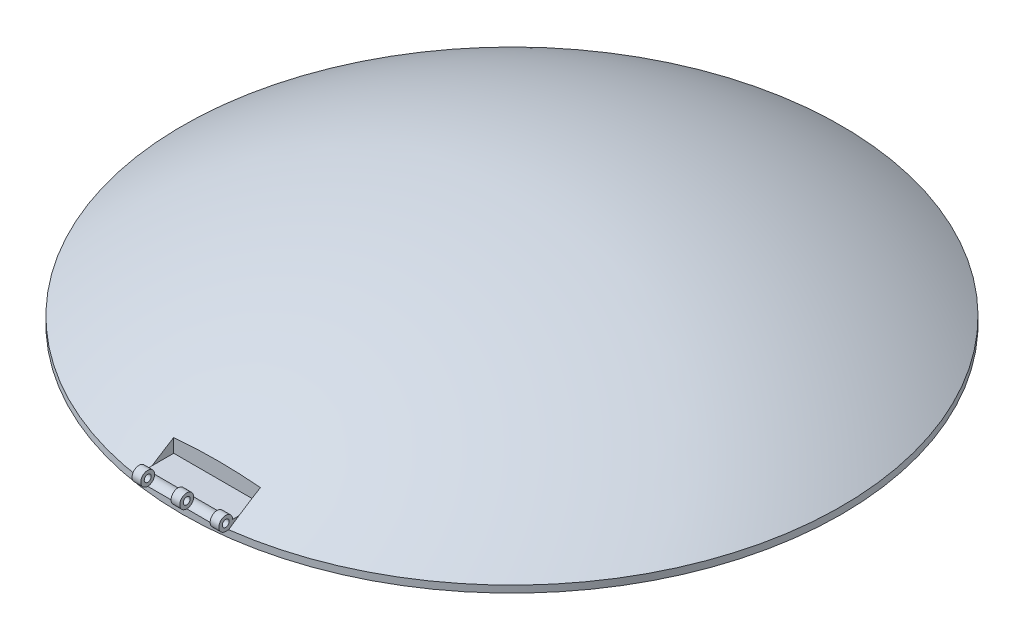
ISO-10303-21;
HEADER;
FILE_DESCRIPTION(('STEP AP214'),'2;1');
FILE_NAME('part.step','',(''),(''),'','','');
FILE_SCHEMA(('AUTOMOTIVE_DESIGN { 1 0 10303 214 1 1 1 1 }'));
ENDSEC;
DATA;
#1=APPLICATION_CONTEXT('core data for automotive mechanical design processes');
#2=APPLICATION_PROTOCOL_DEFINITION('international standard','automotive_design',2000,#1);
#3=PRODUCT_CONTEXT('',#1,'mechanical');
#4=PRODUCT('Part','Part','',(#3));
#5=PRODUCT_RELATED_PRODUCT_CATEGORY('part','',(#4));
#6=PRODUCT_DEFINITION_FORMATION('','',#4);
#7=PRODUCT_DEFINITION_CONTEXT('part definition',#1,'design');
#8=PRODUCT_DEFINITION('design','',#6,#7);
#9=PRODUCT_DEFINITION_SHAPE('','',#8);
#10=(LENGTH_UNIT() NAMED_UNIT(*) SI_UNIT(.MILLI.,.METRE.));
#11=(NAMED_UNIT(*) PLANE_ANGLE_UNIT() SI_UNIT($,.RADIAN.));
#12=(NAMED_UNIT(*) SI_UNIT($,.STERADIAN.) SOLID_ANGLE_UNIT());
#13=UNCERTAINTY_MEASURE_WITH_UNIT(LENGTH_MEASURE(1.E-05),#10,'distance_accuracy_value','');
#14=(GEOMETRIC_REPRESENTATION_CONTEXT(3) GLOBAL_UNCERTAINTY_ASSIGNED_CONTEXT((#13)) GLOBAL_UNIT_ASSIGNED_CONTEXT((#10,
#11,#12)) REPRESENTATION_CONTEXT('',''));
#15=CARTESIAN_POINT('',(0.,0.,0.));
#16=DIRECTION('',(0.,0.,1.));
#17=DIRECTION('',(1.,0.,0.));
#18=AXIS2_PLACEMENT_3D('',#15,#16,#17);
#19=CARTESIAN_POINT('',(-15.875,5.07999999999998,107.95));
#20=DIRECTION('',(0.,1.,0.));
#21=DIRECTION('',(-1.,0.,0.));
#22=AXIS2_PLACEMENT_3D('',#19,#20,#21);
#23=PLANE('',#22);
#24=DIRECTION('',(-1.,0.,0.));
#25=VECTOR('',#24,1.);
#26=CARTESIAN_POINT('',(-12.7,5.07999999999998,118.11));
#27=LINE('',#26,#25);
#28=CARTESIAN_POINT('',(-12.7,5.07999999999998,118.11));
#29=VERTEX_POINT('',#28);
#30=CARTESIAN_POINT('',(-15.875,5.07999999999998,118.11));
#31=VERTEX_POINT('',#30);
#32=EDGE_CURVE('E39',#29,#31,#27,.T.);
#33=ORIENTED_EDGE('',*,*,#32,.F.);
#34=DIRECTION('',(-1.,0.,0.));
#35=VECTOR('',#34,1.);
#36=CARTESIAN_POINT('',(5.59670489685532,5.07999999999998,118.11));
#37=LINE('',#36,#35);
#38=CARTESIAN_POINT('',(-1.5875,5.07999999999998,118.11));
#39=VERTEX_POINT('',#38);
#40=EDGE_CURVE('E111',#29,#39,#37,.F.);
#41=ORIENTED_EDGE('',*,*,#40,.T.);
#42=DIRECTION('',(-1.,0.,0.));
#43=VECTOR('',#42,1.);
#44=CARTESIAN_POINT('',(1.5875,5.07999999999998,118.11));
#45=LINE('',#44,#43);
#46=CARTESIAN_POINT('',(1.5875,5.07999999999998,118.11));
#47=VERTEX_POINT('',#46);
#48=EDGE_CURVE('E207',#39,#47,#45,.F.);
#49=ORIENTED_EDGE('',*,*,#48,.T.);
#50=DIRECTION('',(-1.,0.,0.));
#51=VECTOR('',#50,1.);
#52=CARTESIAN_POINT('',(19.8842048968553,5.07999999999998,118.11));
#53=LINE('',#52,#51);
#54=CARTESIAN_POINT('',(12.7,5.07999999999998,118.11));
#55=VERTEX_POINT('',#54);
#56=EDGE_CURVE('E223',#47,#55,#53,.F.);
#57=ORIENTED_EDGE('',*,*,#56,.T.);
#58=DIRECTION('',(1.,0.,0.));
#59=VECTOR('',#58,1.);
#60=CARTESIAN_POINT('',(12.7,5.07999999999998,118.11));
#61=LINE('',#60,#59);
#62=CARTESIAN_POINT('',(15.875,5.07999999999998,118.11));
#63=VERTEX_POINT('',#62);
#64=EDGE_CURVE('E128',#63,#55,#61,.F.);
#65=ORIENTED_EDGE('',*,*,#64,.F.);
#66=DIRECTION('',(0.,0.,-1.));
#67=VECTOR('',#66,1.);
#68=CARTESIAN_POINT('',(15.875,5.07999999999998,120.65));
#69=LINE('',#68,#67);
#70=CARTESIAN_POINT('',(15.875,5.07999999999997,115.863286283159));
#71=VERTEX_POINT('',#70);
#72=EDGE_CURVE('E165',#63,#71,#69,.T.);
#73=ORIENTED_EDGE('',*,*,#72,.T.);
#74=CARTESIAN_POINT('',(15.875,5.07999999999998,107.95));
#75=VERTEX_POINT('',#74);
#76=EDGE_CURVE('E164',#71,#75,#69,.T.);
#77=ORIENTED_EDGE('',*,*,#76,.T.);
#78=DIRECTION('',(-1.,0.,0.));
#79=VECTOR('',#78,1.);
#80=CARTESIAN_POINT('',(15.875,5.07999999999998,107.95));
#81=LINE('',#80,#79);
#82=CARTESIAN_POINT('',(-15.875,5.07999999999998,107.95));
#83=VERTEX_POINT('',#82);
#84=EDGE_CURVE('E158',#75,#83,#81,.T.);
#85=ORIENTED_EDGE('',*,*,#84,.T.);
#86=DIRECTION('',(0.,0.,1.));
#87=VECTOR('',#86,1.);
#88=CARTESIAN_POINT('',(-15.875,5.07999999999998,107.95));
#89=LINE('',#88,#87);
#90=CARTESIAN_POINT('',(-15.875,5.07999999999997,115.863286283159));
#91=VERTEX_POINT('',#90);
#92=EDGE_CURVE('E162',#83,#91,#89,.T.);
#93=ORIENTED_EDGE('',*,*,#92,.T.);
#94=EDGE_CURVE('E54',#91,#31,#89,.T.);
#95=ORIENTED_EDGE('',*,*,#94,.T.);
#96=EDGE_LOOP('',(#33,#41,#49,#57,#65,#73,#77,#85,#93,#95));
#97=FACE_BOUND('',#96,.T.);
#98=ADVANCED_FACE('F31',(#97),#23,.T.);
#99=CARTESIAN_POINT('',(19.4671024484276,5.07999999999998,120.65));
#100=DIRECTION('',(-1.,0.,0.));
#101=DIRECTION('',(0.,-1.,0.));
#102=AXIS2_PLACEMENT_3D('',#99,#100,#101);
#103=CYLINDRICAL_SURFACE('',#102,1.26999999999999);
#104=CARTESIAN_POINT('',(-15.875,5.07999999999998,120.65));
#105=DIRECTION('',(-1.,0.,0.));
#106=DIRECTION('',(0.,-1.,0.));
#107=AXIS2_PLACEMENT_3D('',#104,#105,#106);
#108=CIRCLE('',#107,1.26999999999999);
#109=CARTESIAN_POINT('',(-15.875,3.80999999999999,120.65));
#110=VERTEX_POINT('',#109);
#111=EDGE_CURVE('E282',#110,#110,#108,.T.);
#112=CARTESIAN_POINT('',(-12.7,5.07999999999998,120.65));
#113=DIRECTION('',(-1.,0.,0.));
#114=DIRECTION('',(0.,-1.,0.));
#115=AXIS2_PLACEMENT_3D('',#112,#113,#114);
#116=CIRCLE('',#115,1.26999999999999);
#117=CARTESIAN_POINT('',(-12.7,3.80999999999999,120.65));
#118=VERTEX_POINT('',#117);
#119=EDGE_CURVE('E11',#118,#118,#116,.T.);
#120=CARTESIAN_POINT('',(-15.875,3.80999999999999,120.65));
#121=CARTESIAN_POINT('',(-15.8419270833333,3.80999999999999,120.65));
#122=CARTESIAN_POINT('',(-15.8088541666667,3.80999999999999,120.65));
#123=CARTESIAN_POINT('',(-15.7427083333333,3.80999999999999,120.65));
#124=CARTESIAN_POINT('',(-15.7096354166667,3.80999999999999,120.65));
#125=CARTESIAN_POINT('',(-15.6434895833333,3.80999999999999,120.65));
#126=CARTESIAN_POINT('',(-15.6104166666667,3.80999999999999,120.65));
#127=CARTESIAN_POINT('',(-15.5442708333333,3.80999999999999,120.65));
#128=CARTESIAN_POINT('',(-15.5111979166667,3.80999999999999,120.65));
#129=CARTESIAN_POINT('',(-15.4450520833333,3.80999999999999,120.65));
#130=CARTESIAN_POINT('',(-15.4119791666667,3.80999999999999,120.65));
#131=CARTESIAN_POINT('',(-15.3458333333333,3.80999999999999,120.65));
#132=CARTESIAN_POINT('',(-15.3127604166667,3.80999999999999,120.65));
#133=CARTESIAN_POINT('',(-15.2466145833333,3.80999999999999,120.65));
#134=CARTESIAN_POINT('',(-15.2135416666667,3.80999999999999,120.65));
#135=CARTESIAN_POINT('',(-15.1473958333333,3.80999999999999,120.65));
#136=CARTESIAN_POINT('',(-15.1143229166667,3.80999999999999,120.65));
#137=CARTESIAN_POINT('',(-15.0481770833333,3.80999999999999,120.65));
#138=CARTESIAN_POINT('',(-15.0151041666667,3.80999999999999,120.65));
#139=CARTESIAN_POINT('',(-14.9489583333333,3.80999999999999,120.65));
#140=CARTESIAN_POINT('',(-14.9158854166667,3.80999999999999,120.65));
#141=CARTESIAN_POINT('',(-14.8497395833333,3.80999999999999,120.65));
#142=CARTESIAN_POINT('',(-14.8166666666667,3.80999999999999,120.65));
#143=CARTESIAN_POINT('',(-14.7505208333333,3.80999999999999,120.65));
#144=CARTESIAN_POINT('',(-14.7174479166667,3.80999999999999,120.65));
#145=CARTESIAN_POINT('',(-14.6513020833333,3.80999999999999,120.65));
#146=CARTESIAN_POINT('',(-14.6182291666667,3.80999999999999,120.65));
#147=CARTESIAN_POINT('',(-14.5520833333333,3.80999999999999,120.65));
#148=CARTESIAN_POINT('',(-14.5190104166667,3.80999999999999,120.65));
#149=CARTESIAN_POINT('',(-14.4528645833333,3.80999999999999,120.65));
#150=CARTESIAN_POINT('',(-14.4197916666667,3.80999999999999,120.65));
#151=CARTESIAN_POINT('',(-14.3536458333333,3.80999999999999,120.65));
#152=CARTESIAN_POINT('',(-14.3205729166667,3.80999999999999,120.65));
#153=CARTESIAN_POINT('',(-14.2544270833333,3.80999999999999,120.65));
#154=CARTESIAN_POINT('',(-14.2213541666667,3.80999999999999,120.65));
#155=CARTESIAN_POINT('',(-14.1552083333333,3.80999999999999,120.65));
#156=CARTESIAN_POINT('',(-14.1221354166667,3.80999999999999,120.65));
#157=CARTESIAN_POINT('',(-14.0559895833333,3.80999999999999,120.65));
#158=CARTESIAN_POINT('',(-14.0229166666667,3.80999999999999,120.65));
#159=CARTESIAN_POINT('',(-13.9567708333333,3.80999999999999,120.65));
#160=CARTESIAN_POINT('',(-13.9236979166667,3.80999999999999,120.65));
#161=CARTESIAN_POINT('',(-13.8575520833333,3.80999999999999,120.65));
#162=CARTESIAN_POINT('',(-13.8244791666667,3.80999999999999,120.65));
#163=CARTESIAN_POINT('',(-13.7583333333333,3.80999999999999,120.65));
#164=CARTESIAN_POINT('',(-13.7252604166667,3.80999999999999,120.65));
#165=CARTESIAN_POINT('',(-13.6591145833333,3.80999999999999,120.65));
#166=CARTESIAN_POINT('',(-13.6260416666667,3.80999999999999,120.65));
#167=CARTESIAN_POINT('',(-13.5598958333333,3.80999999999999,120.65));
#168=CARTESIAN_POINT('',(-13.5268229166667,3.80999999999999,120.65));
#169=CARTESIAN_POINT('',(-13.4606770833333,3.80999999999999,120.65));
#170=CARTESIAN_POINT('',(-13.4276041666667,3.80999999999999,120.65));
#171=CARTESIAN_POINT('',(-13.3614583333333,3.80999999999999,120.65));
#172=CARTESIAN_POINT('',(-13.3283854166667,3.80999999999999,120.65));
#173=CARTESIAN_POINT('',(-13.2622395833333,3.80999999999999,120.65));
#174=CARTESIAN_POINT('',(-13.2291666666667,3.80999999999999,120.65));
#175=CARTESIAN_POINT('',(-13.1630208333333,3.80999999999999,120.65));
#176=CARTESIAN_POINT('',(-13.1299479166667,3.80999999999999,120.65));
#177=CARTESIAN_POINT('',(-13.0638020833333,3.80999999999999,120.65));
#178=CARTESIAN_POINT('',(-13.0307291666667,3.80999999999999,120.65));
#179=CARTESIAN_POINT('',(-12.9645833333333,3.80999999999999,120.65));
#180=CARTESIAN_POINT('',(-12.9315104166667,3.80999999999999,120.65));
#181=CARTESIAN_POINT('',(-12.8653645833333,3.80999999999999,120.65));
#182=CARTESIAN_POINT('',(-12.8322916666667,3.80999999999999,120.65));
#183=CARTESIAN_POINT('',(-12.7661458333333,3.80999999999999,120.65));
#184=CARTESIAN_POINT('',(-12.7330729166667,3.80999999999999,120.65));
#185=CARTESIAN_POINT('',(-12.7,3.80999999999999,120.65));
#186=B_SPLINE_CURVE_WITH_KNOTS('',3,(#120,#121,#122,#123,#124,#125,#126,#127,#128,#129,#130,
#131,#132,#133,#134,#135,#136,#137,#138,#139,#140,#141,#142,#143,#144,#145,#146,#147,#148,#149,
#150,#151,#152,#153,#154,#155,#156,#157,#158,#159,#160,#161,#162,#163,#164,#165,#166,#167,#168,
#169,#170,#171,#172,#173,#174,#175,#176,#177,#178,#179,#180,#181,#182,#183,#184,#185),
.UNSPECIFIED.,.F.,.F.,(4,2,2,2,2,2,2,2,2,2,2,2,2,2,2,2,2,2,2,2,2,2,2,2,2,2,2,2,2,2,2,2,4),(0.,
0.0992187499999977,0.198437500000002,0.29765625,0.396874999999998,0.496093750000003,0.5953125,
0.694531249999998,0.793749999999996,0.892968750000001,0.992187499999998,1.09140625,1.190625,
1.28984375,1.3890625,1.48828125,1.5875,1.68671875,1.7859375,1.88515625,1.984375,2.08359375,
2.1828125,2.28203125,2.38125,2.48046875,2.5796875,2.67890624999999,2.778125,2.87734375,
2.97656249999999,3.07578125,3.175),.UNSPECIFIED.);
#187=EDGE_CURVE('BSEAM295',#110,#118,#186,.T.);
#188=ORIENTED_EDGE('',*,*,#111,.T.);
#189=ORIENTED_EDGE('',*,*,#119,.F.);
#190=ORIENTED_EDGE('',*,*,#187,.T.);
#191=ORIENTED_EDGE('',*,*,#187,.F.);
#192=EDGE_LOOP('',(#188,#190,#189,#191));
#193=FACE_BOUND('',#192,.T.);
#194=ADVANCED_FACE('F295',(#193),#103,.F.);
#195=CARTESIAN_POINT('',(-1.5875,5.07999999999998,120.65));
#196=DIRECTION('',(1.,0.,0.));
#197=DIRECTION('',(0.,0.,-1.));
#198=AXIS2_PLACEMENT_3D('',#195,#196,#197);
#199=CIRCLE('',#198,1.26999999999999);
#200=CARTESIAN_POINT('',(-1.5875,3.80999999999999,120.65));
#201=VERTEX_POINT('',#200);
#202=EDGE_CURVE('E274',#201,#201,#199,.T.);
#203=CARTESIAN_POINT('',(1.5875,5.07999999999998,120.65));
#204=DIRECTION('',(1.,0.,0.));
#205=DIRECTION('',(0.,0.,-1.));
#206=AXIS2_PLACEMENT_3D('',#203,#204,#205);
#207=CIRCLE('',#206,1.26999999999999);
#208=CARTESIAN_POINT('',(1.5875,3.80999999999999,120.65));
#209=VERTEX_POINT('',#208);
#210=EDGE_CURVE('E139',#209,#209,#207,.T.);
#211=CARTESIAN_POINT('',(-1.5875,3.80999999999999,120.65));
#212=CARTESIAN_POINT('',(-1.55442708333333,3.80999999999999,120.65));
#213=CARTESIAN_POINT('',(-1.52135416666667,3.80999999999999,120.65));
#214=CARTESIAN_POINT('',(-1.45520833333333,3.80999999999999,120.65));
#215=CARTESIAN_POINT('',(-1.42213541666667,3.80999999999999,120.65));
#216=CARTESIAN_POINT('',(-1.35598958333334,3.80999999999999,120.65));
#217=CARTESIAN_POINT('',(-1.32291666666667,3.80999999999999,120.65));
#218=CARTESIAN_POINT('',(-1.25677083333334,3.80999999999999,120.65));
#219=CARTESIAN_POINT('',(-1.22369791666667,3.80999999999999,120.65));
#220=CARTESIAN_POINT('',(-1.15755208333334,3.80999999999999,120.65));
#221=CARTESIAN_POINT('',(-1.12447916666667,3.80999999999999,120.65));
#222=CARTESIAN_POINT('',(-1.05833333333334,3.80999999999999,120.65));
#223=CARTESIAN_POINT('',(-1.02526041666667,3.80999999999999,120.65));
#224=CARTESIAN_POINT('',(-0.959114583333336,3.80999999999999,120.65));
#225=CARTESIAN_POINT('',(-0.92604166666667,3.80999999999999,120.65));
#226=CARTESIAN_POINT('',(-0.859895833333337,3.80999999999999,120.65));
#227=CARTESIAN_POINT('',(-0.82682291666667,3.80999999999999,120.65));
#228=CARTESIAN_POINT('',(-0.760677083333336,3.80999999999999,120.65));
#229=CARTESIAN_POINT('',(-0.727604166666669,3.80999999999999,120.65));
#230=CARTESIAN_POINT('',(-0.661458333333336,3.80999999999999,120.65));
#231=CARTESIAN_POINT('',(-0.62838541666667,3.80999999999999,120.65));
#232=CARTESIAN_POINT('',(-0.562239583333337,3.80999999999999,120.65));
#233=CARTESIAN_POINT('',(-0.52916666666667,3.80999999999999,120.65));
#234=CARTESIAN_POINT('',(-0.463020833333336,3.80999999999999,120.65));
#235=CARTESIAN_POINT('',(-0.429947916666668,3.80999999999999,120.65));
#236=CARTESIAN_POINT('',(-0.363802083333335,3.80999999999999,120.65));
#237=CARTESIAN_POINT('',(-0.33072916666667,3.80999999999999,120.65));
#238=CARTESIAN_POINT('',(-0.264583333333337,3.80999999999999,120.65));
#239=CARTESIAN_POINT('',(-0.23151041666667,3.80999999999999,120.65));
#240=CARTESIAN_POINT('',(-0.165364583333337,3.80999999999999,120.65));
#241=CARTESIAN_POINT('',(-0.132291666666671,3.80999999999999,120.65));
#242=CARTESIAN_POINT('',(-0.0661458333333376,3.80999999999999,120.65));
#243=CARTESIAN_POINT('',(-0.0330729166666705,3.80999999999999,120.65));
#244=CARTESIAN_POINT('',(0.0330729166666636,3.80999999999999,120.65));
#245=CARTESIAN_POINT('',(0.0661458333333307,3.80999999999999,120.65));
#246=CARTESIAN_POINT('',(0.132291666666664,3.80999999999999,120.65));
#247=CARTESIAN_POINT('',(0.16536458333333,3.80999999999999,120.65));
#248=CARTESIAN_POINT('',(0.231510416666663,3.80999999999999,120.65));
#249=CARTESIAN_POINT('',(0.26458333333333,3.80999999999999,120.65));
#250=CARTESIAN_POINT('',(0.330729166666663,3.80999999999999,120.65));
#251=CARTESIAN_POINT('',(0.363802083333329,3.80999999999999,120.65));
#252=CARTESIAN_POINT('',(0.429947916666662,3.80999999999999,120.65));
#253=CARTESIAN_POINT('',(0.463020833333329,3.80999999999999,120.65));
#254=CARTESIAN_POINT('',(0.529166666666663,3.80999999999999,120.65));
#255=CARTESIAN_POINT('',(0.56223958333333,3.80999999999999,120.65));
#256=CARTESIAN_POINT('',(0.628385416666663,3.80999999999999,120.65));
#257=CARTESIAN_POINT('',(0.661458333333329,3.80999999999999,120.65));
#258=CARTESIAN_POINT('',(0.727604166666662,3.80999999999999,120.65));
#259=CARTESIAN_POINT('',(0.760677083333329,3.80999999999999,120.65));
#260=CARTESIAN_POINT('',(0.826822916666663,3.80999999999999,120.65));
#261=CARTESIAN_POINT('',(0.85989583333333,3.80999999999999,120.65));
#262=CARTESIAN_POINT('',(0.926041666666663,3.80999999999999,120.65));
#263=CARTESIAN_POINT('',(0.959114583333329,3.80999999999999,120.65));
#264=CARTESIAN_POINT('',(1.02526041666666,3.80999999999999,120.65));
#265=CARTESIAN_POINT('',(1.05833333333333,3.80999999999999,120.65));
#266=CARTESIAN_POINT('',(1.12447916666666,3.80999999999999,120.65));
#267=CARTESIAN_POINT('',(1.15755208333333,3.80999999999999,120.65));
#268=CARTESIAN_POINT('',(1.22369791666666,3.80999999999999,120.65));
#269=CARTESIAN_POINT('',(1.25677083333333,3.80999999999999,120.65));
#270=CARTESIAN_POINT('',(1.32291666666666,3.80999999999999,120.65));
#271=CARTESIAN_POINT('',(1.35598958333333,3.80999999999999,120.65));
#272=CARTESIAN_POINT('',(1.42213541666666,3.80999999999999,120.65));
#273=CARTESIAN_POINT('',(1.45520833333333,3.80999999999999,120.65));
#274=CARTESIAN_POINT('',(1.52135416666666,3.80999999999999,120.65));
#275=CARTESIAN_POINT('',(1.55442708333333,3.80999999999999,120.65));
#276=CARTESIAN_POINT('',(1.5875,3.80999999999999,120.65));
#277=B_SPLINE_CURVE_WITH_KNOTS('',3,(#211,#212,#213,#214,#215,#216,#217,#218,#219,#220,#221,
#222,#223,#224,#225,#226,#227,#228,#229,#230,#231,#232,#233,#234,#235,#236,#237,#238,#239,#240,
#241,#242,#243,#244,#245,#246,#247,#248,#249,#250,#251,#252,#253,#254,#255,#256,#257,#258,#259,
#260,#261,#262,#263,#264,#265,#266,#267,#268,#269,#270,#271,#272,#273,#274,#275,#276),
.UNSPECIFIED.,.F.,.F.,(4,2,2,2,2,2,2,2,2,2,2,2,2,2,2,2,2,2,2,2,2,2,2,2,2,2,2,2,2,2,2,2,4),(0.,
0.0992187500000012,0.198437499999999,0.29765625,0.396874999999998,0.496093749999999,0.5953125,
0.694531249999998,0.793749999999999,0.892968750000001,0.992187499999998,1.09140625,1.190625,
1.28984375,1.3890625,1.48828125,1.5875,1.68671875,1.7859375,1.88515625,1.984375,2.08359375,
2.1828125,2.28203125,2.38125,2.48046875,2.5796875,2.67890625,2.778125,2.87734375,2.9765625,
3.07578125,3.175),.UNSPECIFIED.);
#278=EDGE_CURVE('BSEAM292',#201,#209,#277,.T.);
#279=ORIENTED_EDGE('',*,*,#202,.F.);
#280=ORIENTED_EDGE('',*,*,#210,.T.);
#281=ORIENTED_EDGE('',*,*,#278,.T.);
#282=ORIENTED_EDGE('',*,*,#278,.F.);
#283=EDGE_LOOP('',(#279,#281,#280,#282));
#284=FACE_BOUND('',#283,.T.);
#285=ADVANCED_FACE('F292',(#284),#103,.F.);
#286=CARTESIAN_POINT('',(0.,0.,0.));
#287=DIRECTION('',(0.,1.,0.));
#288=DIRECTION('',(0.,0.,1.));
#289=AXIS2_PLACEMENT_3D('',#286,#287,#288);
#290=PLANE('',#289);
#291=CARTESIAN_POINT('',(0.,0.,0.));
#292=DIRECTION('',(0.,1.,0.));
#293=DIRECTION('',(0.,0.,1.));
#294=AXIS2_PLACEMENT_3D('',#291,#292,#293);
#295=CIRCLE('',#294,120.65);
#296=CARTESIAN_POINT('',(0.,0.,120.65));
#297=VERTEX_POINT('',#296);
#298=EDGE_CURVE('E188',#297,#297,#295,.T.);
#299=ORIENTED_EDGE('',*,*,#298,.F.);
#300=EDGE_LOOP('',(#299));
#301=FACE_BOUND('',#300,.T.);
#302=CARTESIAN_POINT('',(0.,0.,0.));
#303=DIRECTION('',(0.,1.,0.));
#304=DIRECTION('',(0.,0.,1.));
#305=AXIS2_PLACEMENT_3D('',#302,#303,#304);
#306=CIRCLE('',#305,101.6);
#307=CARTESIAN_POINT('',(0.,0.,101.6));
#308=VERTEX_POINT('',#307);
#309=EDGE_CURVE('E184',#308,#308,#306,.T.);
#310=ORIENTED_EDGE('',*,*,#309,.T.);
#311=EDGE_LOOP('',(#310));
#312=FACE_BOUND('',#311,.T.);
#313=ADVANCED_FACE('F294',(#301,#312),#290,.F.);
#314=CARTESIAN_POINT('',(0.,2.54,0.));
#315=DIRECTION('',(0.,-1.,0.));
#316=DIRECTION('',(0.,0.,-1.));
#317=AXIS2_PLACEMENT_3D('',#314,#315,#316);
#318=CYLINDRICAL_SURFACE('',#317,120.65);
#319=CARTESIAN_POINT('',(0.,2.54,0.));
#320=DIRECTION('',(0.,1.,0.));
#321=DIRECTION('',(0.,0.,1.));
#322=AXIS2_PLACEMENT_3D('',#319,#320,#321);
#323=CIRCLE('',#322,120.65);
#324=CARTESIAN_POINT('',(-15.875,2.53999999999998,119.601032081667));
#325=VERTEX_POINT('',#324);
#326=CARTESIAN_POINT('',(0.,2.53999999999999,120.65));
#327=VERTEX_POINT('',#326);
#328=EDGE_CURVE('E194',#325,#327,#323,.T.);
#329=ORIENTED_EDGE('',*,*,#328,.F.);
#330=CARTESIAN_POINT('',(15.875,2.53999999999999,119.601032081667));
#331=VERTEX_POINT('',#330);
#332=EDGE_CURVE('E193',#331,#325,#323,.T.);
#333=ORIENTED_EDGE('',*,*,#332,.F.);
#334=CARTESIAN_POINT('',(0.,2.53999999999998,0.));
#335=DIRECTION('',(0.,1.,0.));
#336=DIRECTION('',(-1.,0.,0.));
#337=AXIS2_PLACEMENT_3D('',#334,#335,#336);
#338=CIRCLE('',#337,120.65);
#339=EDGE_CURVE('E167',#327,#331,#338,.T.);
#340=ORIENTED_EDGE('',*,*,#339,.F.);
#341=EDGE_LOOP('',(#329,#333,#340));
#342=FACE_BOUND('',#341,.T.);
#343=ORIENTED_EDGE('',*,*,#298,.T.);
#344=EDGE_LOOP('',(#343));
#345=FACE_BOUND('',#344,.T.);
#346=ADVANCED_FACE('F302',(#342,#345),#318,.T.);
#347=CARTESIAN_POINT('',(0.,-169.439166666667,0.));
#348=DIRECTION('',(0.,0.,1.));
#349=DIRECTION('',(1.,0.,0.));
#350=AXIS2_PLACEMENT_3D('',#347,#348,#349);
#351=SPHERICAL_SURFACE('',#350,210.079166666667);
#352=CARTESIAN_POINT('',(-15.875,-169.439166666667,0.));
#353=DIRECTION('',(-1.,0.,0.));
#354=DIRECTION('',(0.,0.,1.));
#355=AXIS2_PLACEMENT_3D('',#352,#353,#354);
#356=CIRCLE('',#355,209.478496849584);
#357=CARTESIAN_POINT('',(-15.875,10.0825260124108,107.95));
#358=VERTEX_POINT('',#357);
#359=EDGE_CURVE('E204',#358,#91,#356,.F.);
#360=ORIENTED_EDGE('',*,*,#359,.F.);
#361=CARTESIAN_POINT('',(0.,-169.439166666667,107.95));
#362=DIRECTION('',(0.,0.,1.));
#363=DIRECTION('',(1.,0.,0.));
#364=AXIS2_PLACEMENT_3D('',#361,#362,#363);
#365=CIRCLE('',#364,180.222234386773);
#366=CARTESIAN_POINT('',(15.875,10.0825260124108,107.95));
#367=VERTEX_POINT('',#366);
#368=EDGE_CURVE('E197',#358,#367,#365,.F.);
#369=ORIENTED_EDGE('',*,*,#368,.T.);
#370=CARTESIAN_POINT('',(15.875,-169.439166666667,0.));
#371=DIRECTION('',(1.,0.,0.));
#372=DIRECTION('',(0.,0.,-1.));
#373=AXIS2_PLACEMENT_3D('',#370,#371,#372);
#374=CIRCLE('',#373,209.478496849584);
#375=EDGE_CURVE('E200',#71,#367,#374,.F.);
#376=ORIENTED_EDGE('',*,*,#375,.F.);
#377=EDGE_CURVE('E201',#331,#71,#374,.F.);
#378=ORIENTED_EDGE('',*,*,#377,.F.);
#379=ORIENTED_EDGE('',*,*,#332,.T.);
#380=CARTESIAN_POINT('',(-15.875,-169.439166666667,0.));
#381=DIRECTION('',(1.,0.,0.));
#382=DIRECTION('',(0.,1.,0.));
#383=AXIS2_PLACEMENT_3D('',#380,#381,#382);
#384=CIRCLE('',#383,209.478496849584);
#385=EDGE_CURVE('E177',#325,#91,#384,.F.);
#386=ORIENTED_EDGE('',*,*,#385,.T.);
#387=EDGE_LOOP('',(#360,#369,#376,#378,#379,#386));
#388=FACE_BOUND('',#387,.T.);
#389=ADVANCED_FACE('F33',(#388),#351,.T.);
#390=CARTESIAN_POINT('',(0.,12.7,0.));
#391=DIRECTION('',(0.,-1.,0.));
#392=DIRECTION('',(0.,0.,-1.));
#393=AXIS2_PLACEMENT_3D('',#390,#391,#392);
#394=CYLINDRICAL_SURFACE('',#393,101.6);
#395=CARTESIAN_POINT('',(0.,12.7,0.));
#396=DIRECTION('',(0.,1.,0.));
#397=DIRECTION('',(0.,0.,1.));
#398=AXIS2_PLACEMENT_3D('',#395,#396,#397);
#399=CIRCLE('',#398,101.6);
#400=CARTESIAN_POINT('',(0.,12.7,101.6));
#401=VERTEX_POINT('',#400);
#402=EDGE_CURVE('E185',#401,#401,#399,.T.);
#403=ORIENTED_EDGE('',*,*,#402,.T.);
#404=EDGE_LOOP('',(#403));
#405=FACE_BOUND('',#404,.T.);
#406=ORIENTED_EDGE('',*,*,#309,.F.);
#407=EDGE_LOOP('',(#406));
#408=FACE_BOUND('',#407,.T.);
#409=ADVANCED_FACE('F333',(#405,#408),#394,.F.);
#410=CARTESIAN_POINT('',(0.,12.7,0.));
#411=DIRECTION('',(0.,1.,0.));
#412=DIRECTION('',(0.,0.,1.));
#413=AXIS2_PLACEMENT_3D('',#410,#411,#412);
#414=PLANE('',#413);
#415=ORIENTED_EDGE('',*,*,#402,.F.);
#416=EDGE_LOOP('',(#415));
#417=FACE_BOUND('',#416,.T.);
#418=ADVANCED_FACE('F330',(#417),#414,.F.);
#419=CARTESIAN_POINT('',(-15.875,12.7,107.95));
#420=DIRECTION('',(-1.,0.,0.));
#421=DIRECTION('',(0.,0.,1.));
#422=AXIS2_PLACEMENT_3D('',#419,#420,#421);
#423=PLANE('',#422);
#424=ORIENTED_EDGE('',*,*,#359,.T.);
#425=ORIENTED_EDGE('',*,*,#92,.F.);
#426=DIRECTION('',(0.,-1.,0.));
#427=VECTOR('',#426,1.);
#428=CARTESIAN_POINT('',(-15.875,12.7,107.95));
#429=LINE('',#428,#427);
#430=EDGE_CURVE('E179',#358,#83,#429,.T.);
#431=ORIENTED_EDGE('',*,*,#430,.F.);
#432=EDGE_LOOP('',(#424,#425,#431));
#433=FACE_BOUND('',#432,.T.);
#434=ADVANCED_FACE('F246',(#433),#423,.F.);
#435=CARTESIAN_POINT('',(15.875,2.53999999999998,107.95));
#436=DIRECTION('',(1.,0.,0.));
#437=DIRECTION('',(0.,0.,-1.));
#438=AXIS2_PLACEMENT_3D('',#435,#436,#437);
#439=PLANE('',#438);
#440=DIRECTION('',(0.,1.,0.));
#441=VECTOR('',#440,1.);
#442=CARTESIAN_POINT('',(15.875,2.53999999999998,107.95));
#443=LINE('',#442,#441);
#444=EDGE_CURVE('E181',#75,#367,#443,.T.);
#445=ORIENTED_EDGE('',*,*,#444,.F.);
#446=ORIENTED_EDGE('',*,*,#76,.F.);
#447=ORIENTED_EDGE('',*,*,#375,.T.);
#448=EDGE_LOOP('',(#445,#446,#447));
#449=FACE_BOUND('',#448,.T.);
#450=ADVANCED_FACE('F236',(#449),#439,.F.);
#451=CARTESIAN_POINT('',(-15.875,2.53999999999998,107.95));
#452=DIRECTION('',(0.,0.,1.));
#453=DIRECTION('',(1.,0.,0.));
#454=AXIS2_PLACEMENT_3D('',#451,#452,#453);
#455=PLANE('',#454);
#456=ORIENTED_EDGE('',*,*,#84,.F.);
#457=ORIENTED_EDGE('',*,*,#444,.T.);
#458=ORIENTED_EDGE('',*,*,#368,.F.);
#459=ORIENTED_EDGE('',*,*,#430,.T.);
#460=EDGE_LOOP('',(#456,#457,#458,#459));
#461=FACE_BOUND('',#460,.T.);
#462=ADVANCED_FACE('F243',(#461),#455,.T.);
#463=CARTESIAN_POINT('',(-15.875,2.53999999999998,107.95));
#464=DIRECTION('',(0.,1.,0.));
#465=DIRECTION('',(-1.,0.,0.));
#466=AXIS2_PLACEMENT_3D('',#463,#464,#465);
#467=PLANE('',#466);
#468=DIRECTION('',(0.,0.,1.));
#469=VECTOR('',#468,1.);
#470=CARTESIAN_POINT('',(-15.875,2.53999999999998,107.95));
#471=LINE('',#470,#469);
#472=CARTESIAN_POINT('',(-15.875,2.53999999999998,120.65));
#473=VERTEX_POINT('',#472);
#474=EDGE_CURVE('E157',#325,#473,#471,.T.);
#475=ORIENTED_EDGE('',*,*,#474,.F.);
#476=ORIENTED_EDGE('',*,*,#328,.T.);
#477=DIRECTION('',(-1.,0.,0.));
#478=VECTOR('',#477,1.);
#479=CARTESIAN_POINT('',(1.5875,2.53999999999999,120.65));
#480=LINE('',#479,#478);
#481=CARTESIAN_POINT('',(-1.5875,2.53999999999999,120.65));
#482=VERTEX_POINT('',#481);
#483=EDGE_CURVE('E153',#482,#327,#480,.F.);
#484=ORIENTED_EDGE('',*,*,#483,.F.);
#485=DIRECTION('',(1.,0.,0.));
#486=VECTOR('',#485,1.);
#487=CARTESIAN_POINT('',(-15.875,2.53999999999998,120.65));
#488=LINE('',#487,#486);
#489=CARTESIAN_POINT('',(-12.7,2.53999999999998,120.65));
#490=VERTEX_POINT('',#489);
#491=EDGE_CURVE('E171',#490,#482,#488,.T.);
#492=ORIENTED_EDGE('',*,*,#491,.F.);
#493=EDGE_CURVE('E132',#473,#490,#488,.T.);
#494=ORIENTED_EDGE('',*,*,#493,.F.);
#495=EDGE_LOOP('',(#475,#476,#484,#492,#494));
#496=FACE_BOUND('',#495,.T.);
#497=ADVANCED_FACE('F252',(#496),#467,.F.);
#498=CARTESIAN_POINT('',(1.5875,2.53999999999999,120.65));
#499=VERTEX_POINT('',#498);
#500=EDGE_CURVE('E172',#327,#499,#488,.T.);
#501=ORIENTED_EDGE('',*,*,#500,.F.);
#502=ORIENTED_EDGE('',*,*,#339,.T.);
#503=DIRECTION('',(0.,0.,-1.));
#504=VECTOR('',#503,1.);
#505=CARTESIAN_POINT('',(15.875,2.53999999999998,120.65));
#506=LINE('',#505,#504);
#507=CARTESIAN_POINT('',(15.875,2.53999999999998,120.65));
#508=VERTEX_POINT('',#507);
#509=EDGE_CURVE('E161',#508,#331,#506,.T.);
#510=ORIENTED_EDGE('',*,*,#509,.F.);
#511=DIRECTION('',(1.,0.,0.));
#512=VECTOR('',#511,1.);
#513=CARTESIAN_POINT('',(12.7,2.53999999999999,120.65));
#514=LINE('',#513,#512);
#515=CARTESIAN_POINT('',(12.7,2.53999999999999,120.65));
#516=VERTEX_POINT('',#515);
#517=EDGE_CURVE('E145',#508,#516,#514,.F.);
#518=ORIENTED_EDGE('',*,*,#517,.T.);
#519=EDGE_CURVE('E169',#499,#516,#488,.T.);
#520=ORIENTED_EDGE('',*,*,#519,.F.);
#521=EDGE_LOOP('',(#501,#502,#510,#518,#520));
#522=FACE_BOUND('',#521,.T.);
#523=ADVANCED_FACE('F228',(#522),#467,.F.);
#524=CARTESIAN_POINT('',(-15.875,5.07999999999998,107.95));
#525=DIRECTION('',(1.,0.,0.));
#526=DIRECTION('',(0.,1.,0.));
#527=AXIS2_PLACEMENT_3D('',#524,#525,#526);
#528=PLANE('',#527);
#529=ORIENTED_EDGE('',*,*,#111,.F.);
#530=EDGE_LOOP('',(#529));
#531=FACE_BOUND('',#530,.T.);
#532=ORIENTED_EDGE('',*,*,#474,.T.);
#533=CARTESIAN_POINT('',(-15.875,5.07999999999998,120.65));
#534=DIRECTION('',(-1.,0.,0.));
#535=DIRECTION('',(0.,-1.,0.));
#536=AXIS2_PLACEMENT_3D('',#533,#534,#535);
#537=CIRCLE('',#536,2.54);
#538=EDGE_CURVE('E134',#473,#31,#537,.T.);
#539=ORIENTED_EDGE('',*,*,#538,.T.);
#540=ORIENTED_EDGE('',*,*,#94,.F.);
#541=ORIENTED_EDGE('',*,*,#385,.F.);
#542=EDGE_LOOP('',(#532,#539,#540,#541));
#543=FACE_BOUND('',#542,.T.);
#544=ADVANCED_FACE('F249',(#531,#543),#528,.F.);
#545=CARTESIAN_POINT('',(15.875,5.07999999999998,120.65));
#546=DIRECTION('',(-1.,0.,0.));
#547=DIRECTION('',(0.,-1.,0.));
#548=AXIS2_PLACEMENT_3D('',#545,#546,#547);
#549=PLANE('',#548);
#550=CARTESIAN_POINT('',(15.875,5.07999999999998,120.65));
#551=DIRECTION('',(-1.,0.,0.));
#552=DIRECTION('',(0.,-1.,0.));
#553=AXIS2_PLACEMENT_3D('',#550,#551,#552);
#554=CIRCLE('',#553,1.26999999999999);
#555=CARTESIAN_POINT('',(15.875,3.80999999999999,120.65));
#556=VERTEX_POINT('',#555);
#557=EDGE_CURVE('E277',#556,#556,#554,.F.);
#558=ORIENTED_EDGE('',*,*,#557,.F.);
#559=EDGE_LOOP('',(#558));
#560=FACE_BOUND('',#559,.T.);
#561=CARTESIAN_POINT('',(15.875,5.07999999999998,120.65));
#562=DIRECTION('',(1.,0.,0.));
#563=DIRECTION('',(0.,1.,0.));
#564=AXIS2_PLACEMENT_3D('',#561,#562,#563);
#565=CIRCLE('',#564,2.54);
#566=EDGE_CURVE('E133',#63,#508,#565,.T.);
#567=ORIENTED_EDGE('',*,*,#566,.T.);
#568=ORIENTED_EDGE('',*,*,#509,.T.);
#569=ORIENTED_EDGE('',*,*,#377,.T.);
#570=ORIENTED_EDGE('',*,*,#72,.F.);
#571=EDGE_LOOP('',(#567,#568,#569,#570));
#572=FACE_BOUND('',#571,.T.);
#573=ADVANCED_FACE('F230',(#560,#572),#549,.F.);
#574=CARTESIAN_POINT('',(1.5875,5.07999999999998,120.65));
#575=DIRECTION('',(-1.,0.,0.));
#576=DIRECTION('',(0.,0.,1.));
#577=AXIS2_PLACEMENT_3D('',#574,#575,#576);
#578=CYLINDRICAL_SURFACE('',#577,2.54);
#579=CARTESIAN_POINT('',(-1.5875,5.07999999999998,120.65));
#580=DIRECTION('',(1.,0.,0.));
#581=DIRECTION('',(0.,0.,-1.));
#582=AXIS2_PLACEMENT_3D('',#579,#580,#581);
#583=CIRCLE('',#582,2.54);
#584=EDGE_CURVE('E149',#39,#482,#583,.T.);
#585=ORIENTED_EDGE('',*,*,#584,.T.);
#586=ORIENTED_EDGE('',*,*,#483,.T.);
#587=ORIENTED_EDGE('',*,*,#500,.T.);
#588=CARTESIAN_POINT('',(1.5875,5.07999999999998,120.65));
#589=DIRECTION('',(1.,0.,0.));
#590=DIRECTION('',(0.,0.,-1.));
#591=AXIS2_PLACEMENT_3D('',#588,#589,#590);
#592=CIRCLE('',#591,2.54);
#593=EDGE_CURVE('E150',#47,#499,#592,.T.);
#594=ORIENTED_EDGE('',*,*,#593,.F.);
#595=ORIENTED_EDGE('',*,*,#48,.F.);
#596=EDGE_LOOP('',(#585,#586,#587,#594,#595));
#597=FACE_BOUND('',#596,.T.);
#598=ADVANCED_FACE('F261',(#597),#578,.T.);
#599=CARTESIAN_POINT('',(1.5875,5.07999999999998,120.65));
#600=DIRECTION('',(1.,0.,0.));
#601=DIRECTION('',(0.,0.,-1.));
#602=AXIS2_PLACEMENT_3D('',#599,#600,#601);
#603=PLANE('',#602);
#604=ORIENTED_EDGE('',*,*,#593,.T.);
#605=CARTESIAN_POINT('',(1.5875,5.07999999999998,120.65));
#606=DIRECTION('',(1.,0.,0.));
#607=DIRECTION('',(0.,0.,-1.));
#608=AXIS2_PLACEMENT_3D('',#605,#606,#607);
#609=CIRCLE('',#608,2.54);
#610=EDGE_CURVE('E117',#499,#47,#609,.T.);
#611=ORIENTED_EDGE('',*,*,#610,.T.);
#612=EDGE_LOOP('',(#604,#611));
#613=FACE_BOUND('',#612,.T.);
#614=ORIENTED_EDGE('',*,*,#210,.F.);
#615=EDGE_LOOP('',(#614));
#616=FACE_BOUND('',#615,.T.);
#617=ADVANCED_FACE('F264',(#613,#616),#603,.T.);
#618=CARTESIAN_POINT('',(-1.5875,5.07999999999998,120.65));
#619=DIRECTION('',(1.,0.,0.));
#620=DIRECTION('',(0.,0.,-1.));
#621=AXIS2_PLACEMENT_3D('',#618,#619,#620);
#622=PLANE('',#621);
#623=ORIENTED_EDGE('',*,*,#584,.F.);
#624=CARTESIAN_POINT('',(-1.5875,5.07999999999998,120.65));
#625=DIRECTION('',(1.,0.,0.));
#626=DIRECTION('',(0.,0.,-1.));
#627=AXIS2_PLACEMENT_3D('',#624,#625,#626);
#628=CIRCLE('',#627,2.54);
#629=EDGE_CURVE('E114',#482,#39,#628,.T.);
#630=ORIENTED_EDGE('',*,*,#629,.F.);
#631=EDGE_LOOP('',(#623,#630));
#632=FACE_BOUND('',#631,.T.);
#633=ORIENTED_EDGE('',*,*,#202,.T.);
#634=EDGE_LOOP('',(#633));
#635=FACE_BOUND('',#634,.T.);
#636=ADVANCED_FACE('F267',(#632,#635),#622,.F.);
#637=CARTESIAN_POINT('',(12.7,5.07999999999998,120.65));
#638=DIRECTION('',(1.,0.,0.));
#639=DIRECTION('',(0.,1.,0.));
#640=AXIS2_PLACEMENT_3D('',#637,#638,#639);
#641=CYLINDRICAL_SURFACE('',#640,2.54);
#642=ORIENTED_EDGE('',*,*,#517,.F.);
#643=ORIENTED_EDGE('',*,*,#566,.F.);
#644=ORIENTED_EDGE('',*,*,#64,.T.);
#645=CARTESIAN_POINT('',(12.7,5.07999999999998,120.65));
#646=DIRECTION('',(1.,0.,0.));
#647=DIRECTION('',(0.,1.,0.));
#648=AXIS2_PLACEMENT_3D('',#645,#646,#647);
#649=CIRCLE('',#648,2.54);
#650=EDGE_CURVE('E137',#55,#516,#649,.T.);
#651=ORIENTED_EDGE('',*,*,#650,.T.);
#652=EDGE_LOOP('',(#642,#643,#644,#651));
#653=FACE_BOUND('',#652,.T.);
#654=ADVANCED_FACE('F215',(#653),#641,.T.);
#655=CARTESIAN_POINT('',(12.7,5.07999999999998,120.65));
#656=DIRECTION('',(1.,0.,0.));
#657=DIRECTION('',(0.,1.,0.));
#658=AXIS2_PLACEMENT_3D('',#655,#656,#657);
#659=PLANE('',#658);
#660=CARTESIAN_POINT('',(12.7,5.07999999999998,120.65));
#661=DIRECTION('',(1.,0.,0.));
#662=DIRECTION('',(0.,1.,0.));
#663=AXIS2_PLACEMENT_3D('',#660,#661,#662);
#664=CIRCLE('',#663,2.54);
#665=EDGE_CURVE('E221',#516,#55,#664,.T.);
#666=ORIENTED_EDGE('',*,*,#665,.F.);
#667=ORIENTED_EDGE('',*,*,#650,.F.);
#668=EDGE_LOOP('',(#666,#667));
#669=FACE_BOUND('',#668,.T.);
#670=CARTESIAN_POINT('',(12.7,5.07999999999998,120.65));
#671=DIRECTION('',(1.,0.,0.));
#672=DIRECTION('',(0.,1.,0.));
#673=AXIS2_PLACEMENT_3D('',#670,#671,#672);
#674=CIRCLE('',#673,1.26999999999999);
#675=CARTESIAN_POINT('',(12.7,3.80999999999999,120.65));
#676=VERTEX_POINT('',#675);
#677=EDGE_CURVE('E272',#676,#676,#674,.T.);
#678=ORIENTED_EDGE('',*,*,#677,.T.);
#679=EDGE_LOOP('',(#678));
#680=FACE_BOUND('',#679,.T.);
#681=ADVANCED_FACE('F219',(#669,#680),#659,.F.);
#682=CARTESIAN_POINT('',(-12.7,5.07999999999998,120.65));
#683=DIRECTION('',(-1.,0.,0.));
#684=DIRECTION('',(0.,-1.,0.));
#685=AXIS2_PLACEMENT_3D('',#682,#683,#684);
#686=CYLINDRICAL_SURFACE('',#685,2.54);
#687=ORIENTED_EDGE('',*,*,#493,.T.);
#688=CARTESIAN_POINT('',(-12.7,5.07999999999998,120.65));
#689=DIRECTION('',(-1.,0.,0.));
#690=DIRECTION('',(0.,-1.,0.));
#691=AXIS2_PLACEMENT_3D('',#688,#689,#690);
#692=CIRCLE('',#691,2.54);
#693=EDGE_CURVE('E123',#490,#29,#692,.T.);
#694=ORIENTED_EDGE('',*,*,#693,.T.);
#695=ORIENTED_EDGE('',*,*,#32,.T.);
#696=ORIENTED_EDGE('',*,*,#538,.F.);
#697=EDGE_LOOP('',(#687,#694,#695,#696));
#698=FACE_BOUND('',#697,.T.);
#699=ADVANCED_FACE('F130',(#698),#686,.T.);
#700=CARTESIAN_POINT('',(-12.7,5.07999999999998,120.65));
#701=DIRECTION('',(-1.,0.,0.));
#702=DIRECTION('',(0.,-1.,0.));
#703=AXIS2_PLACEMENT_3D('',#700,#701,#702);
#704=PLANE('',#703);
#705=ORIENTED_EDGE('',*,*,#119,.T.);
#706=EDGE_LOOP('',(#705));
#707=FACE_BOUND('',#706,.T.);
#708=ORIENTED_EDGE('',*,*,#693,.F.);
#709=CARTESIAN_POINT('',(-12.7,5.07999999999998,120.65));
#710=DIRECTION('',(1.,0.,0.));
#711=DIRECTION('',(0.,1.,0.));
#712=AXIS2_PLACEMENT_3D('',#709,#710,#711);
#713=CIRCLE('',#712,2.54);
#714=EDGE_CURVE('E46',#490,#29,#713,.T.);
#715=ORIENTED_EDGE('',*,*,#714,.T.);
#716=EDGE_LOOP('',(#708,#715));
#717=FACE_BOUND('',#716,.T.);
#718=ADVANCED_FACE('F121',(#707,#717),#704,.F.);
#719=CARTESIAN_POINT('',(12.7,3.80999999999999,120.65));
#720=CARTESIAN_POINT('',(12.7330729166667,3.80999999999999,120.65));
#721=CARTESIAN_POINT('',(12.7661458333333,3.80999999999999,120.65));
#722=CARTESIAN_POINT('',(12.8322916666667,3.80999999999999,120.65));
#723=CARTESIAN_POINT('',(12.8653645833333,3.80999999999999,120.65));
#724=CARTESIAN_POINT('',(12.9315104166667,3.80999999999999,120.65));
#725=CARTESIAN_POINT('',(12.9645833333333,3.80999999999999,120.65));
#726=CARTESIAN_POINT('',(13.0307291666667,3.80999999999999,120.65));
#727=CARTESIAN_POINT('',(13.0638020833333,3.80999999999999,120.65));
#728=CARTESIAN_POINT('',(13.1299479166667,3.80999999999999,120.65));
#729=CARTESIAN_POINT('',(13.1630208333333,3.80999999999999,120.65));
#730=CARTESIAN_POINT('',(13.2291666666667,3.80999999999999,120.65));
#731=CARTESIAN_POINT('',(13.2622395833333,3.80999999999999,120.65));
#732=CARTESIAN_POINT('',(13.3283854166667,3.80999999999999,120.65));
#733=CARTESIAN_POINT('',(13.3614583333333,3.80999999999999,120.65));
#734=CARTESIAN_POINT('',(13.4276041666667,3.80999999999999,120.65));
#735=CARTESIAN_POINT('',(13.4606770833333,3.80999999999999,120.65));
#736=CARTESIAN_POINT('',(13.5268229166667,3.80999999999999,120.65));
#737=CARTESIAN_POINT('',(13.5598958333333,3.80999999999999,120.65));
#738=CARTESIAN_POINT('',(13.6260416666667,3.80999999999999,120.65));
#739=CARTESIAN_POINT('',(13.6591145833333,3.80999999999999,120.65));
#740=CARTESIAN_POINT('',(13.7252604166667,3.80999999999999,120.65));
#741=CARTESIAN_POINT('',(13.7583333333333,3.80999999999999,120.65));
#742=CARTESIAN_POINT('',(13.8244791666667,3.80999999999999,120.65));
#743=CARTESIAN_POINT('',(13.8575520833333,3.80999999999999,120.65));
#744=CARTESIAN_POINT('',(13.9236979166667,3.80999999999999,120.65));
#745=CARTESIAN_POINT('',(13.9567708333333,3.80999999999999,120.65));
#746=CARTESIAN_POINT('',(14.0229166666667,3.80999999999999,120.65));
#747=CARTESIAN_POINT('',(14.0559895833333,3.80999999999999,120.65));
#748=CARTESIAN_POINT('',(14.1221354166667,3.80999999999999,120.65));
#749=CARTESIAN_POINT('',(14.1552083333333,3.80999999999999,120.65));
#750=CARTESIAN_POINT('',(14.2213541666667,3.80999999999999,120.65));
#751=CARTESIAN_POINT('',(14.2544270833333,3.80999999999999,120.65));
#752=CARTESIAN_POINT('',(14.3205729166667,3.80999999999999,120.65));
#753=CARTESIAN_POINT('',(14.3536458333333,3.80999999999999,120.65));
#754=CARTESIAN_POINT('',(14.4197916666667,3.80999999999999,120.65));
#755=CARTESIAN_POINT('',(14.4528645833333,3.80999999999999,120.65));
#756=CARTESIAN_POINT('',(14.5190104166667,3.80999999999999,120.65));
#757=CARTESIAN_POINT('',(14.5520833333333,3.80999999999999,120.65));
#758=CARTESIAN_POINT('',(14.6182291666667,3.80999999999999,120.65));
#759=CARTESIAN_POINT('',(14.6513020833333,3.80999999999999,120.65));
#760=CARTESIAN_POINT('',(14.7174479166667,3.80999999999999,120.65));
#761=CARTESIAN_POINT('',(14.7505208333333,3.80999999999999,120.65));
#762=CARTESIAN_POINT('',(14.8166666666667,3.80999999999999,120.65));
#763=CARTESIAN_POINT('',(14.8497395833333,3.80999999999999,120.65));
#764=CARTESIAN_POINT('',(14.9158854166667,3.80999999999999,120.65));
#765=CARTESIAN_POINT('',(14.9489583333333,3.80999999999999,120.65));
#766=CARTESIAN_POINT('',(15.0151041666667,3.80999999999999,120.65));
#767=CARTESIAN_POINT('',(15.0481770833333,3.80999999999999,120.65));
#768=CARTESIAN_POINT('',(15.1143229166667,3.80999999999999,120.65));
#769=CARTESIAN_POINT('',(15.1473958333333,3.80999999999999,120.65));
#770=CARTESIAN_POINT('',(15.2135416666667,3.80999999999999,120.65));
#771=CARTESIAN_POINT('',(15.2466145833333,3.80999999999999,120.65));
#772=CARTESIAN_POINT('',(15.3127604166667,3.80999999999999,120.65));
#773=CARTESIAN_POINT('',(15.3458333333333,3.80999999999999,120.65));
#774=CARTESIAN_POINT('',(15.4119791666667,3.80999999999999,120.65));
#775=CARTESIAN_POINT('',(15.4450520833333,3.80999999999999,120.65));
#776=CARTESIAN_POINT('',(15.5111979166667,3.80999999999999,120.65));
#777=CARTESIAN_POINT('',(15.5442708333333,3.80999999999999,120.65));
#778=CARTESIAN_POINT('',(15.6104166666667,3.80999999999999,120.65));
#779=CARTESIAN_POINT('',(15.6434895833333,3.80999999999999,120.65));
#780=CARTESIAN_POINT('',(15.7096354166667,3.80999999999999,120.65));
#781=CARTESIAN_POINT('',(15.7427083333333,3.80999999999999,120.65));
#782=CARTESIAN_POINT('',(15.8088541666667,3.80999999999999,120.65));
#783=CARTESIAN_POINT('',(15.8419270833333,3.80999999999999,120.65));
#784=CARTESIAN_POINT('',(15.875,3.80999999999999,120.65));
#785=B_SPLINE_CURVE_WITH_KNOTS('',3,(#719,#720,#721,#722,#723,#724,#725,#726,#727,#728,#729,
#730,#731,#732,#733,#734,#735,#736,#737,#738,#739,#740,#741,#742,#743,#744,#745,#746,#747,#748,
#749,#750,#751,#752,#753,#754,#755,#756,#757,#758,#759,#760,#761,#762,#763,#764,#765,#766,#767,
#768,#769,#770,#771,#772,#773,#774,#775,#776,#777,#778,#779,#780,#781,#782,#783,#784),
.UNSPECIFIED.,.F.,.F.,(4,2,2,2,2,2,2,2,2,2,2,2,2,2,2,2,2,2,2,2,2,2,2,2,2,2,2,2,2,2,2,2,4),(0.,
0.0992187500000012,0.198437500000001,0.29765625,0.396875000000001,0.496093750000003,0.5953125,
0.694531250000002,0.793750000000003,0.892968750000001,0.992187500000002,1.09140625,1.190625,
1.28984375,1.3890625,1.48828125,1.5875,1.68671875,1.7859375,1.88515625,1.984375,2.08359375,
2.1828125,2.28203125,2.38125,2.48046875,2.5796875,2.67890625,2.778125,2.87734375,2.9765625,
3.07578125,3.175),.UNSPECIFIED.);
#786=EDGE_CURVE('BSEAM297',#676,#556,#785,.T.);
#787=ORIENTED_EDGE('',*,*,#677,.F.);
#788=ORIENTED_EDGE('',*,*,#557,.T.);
#789=ORIENTED_EDGE('',*,*,#786,.T.);
#790=ORIENTED_EDGE('',*,*,#786,.F.);
#791=EDGE_LOOP('',(#787,#789,#788,#790));
#792=FACE_BOUND('',#791,.T.);
#793=ADVANCED_FACE('F297',(#792),#103,.F.);
#794=CARTESIAN_POINT('',(19.8842048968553,5.07999999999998,120.65));
#795=DIRECTION('',(-1.,0.,0.));
#796=DIRECTION('',(0.,0.,1.));
#797=AXIS2_PLACEMENT_3D('',#794,#795,#796);
#798=CYLINDRICAL_SURFACE('',#797,2.54);
#799=ORIENTED_EDGE('',*,*,#519,.T.);
#800=ORIENTED_EDGE('',*,*,#665,.T.);
#801=ORIENTED_EDGE('',*,*,#56,.F.);
#802=ORIENTED_EDGE('',*,*,#610,.F.);
#803=EDGE_LOOP('',(#799,#800,#801,#802));
#804=FACE_BOUND('',#803,.T.);
#805=ADVANCED_FACE('F255',(#804),#798,.F.);
#806=CARTESIAN_POINT('',(5.59670489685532,5.07999999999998,120.65));
#807=DIRECTION('',(-1.,0.,0.));
#808=DIRECTION('',(0.,-1.,0.));
#809=AXIS2_PLACEMENT_3D('',#806,#807,#808);
#810=CYLINDRICAL_SURFACE('',#809,2.54);
#811=ORIENTED_EDGE('',*,*,#714,.F.);
#812=ORIENTED_EDGE('',*,*,#491,.T.);
#813=ORIENTED_EDGE('',*,*,#629,.T.);
#814=ORIENTED_EDGE('',*,*,#40,.F.);
#815=EDGE_LOOP('',(#811,#812,#813,#814));
#816=FACE_BOUND('',#815,.T.);
#817=ADVANCED_FACE('F112',(#816),#810,.F.);
#818=CLOSED_SHELL('',(#98,#194,#285,#313,#346,#389,#409,#418,#434,#450,#462,#497,#523,#544,#573,
#598,#617,#636,#654,#681,#699,#718,#793,#805,#817));
#819=MANIFOLD_SOLID_BREP('B2',#818);
#820=ADVANCED_BREP_SHAPE_REPRESENTATION('',(#18,#819),#14);
#821=SHAPE_DEFINITION_REPRESENTATION(#9,#820);
ENDSEC;
END-ISO-10303-21;
